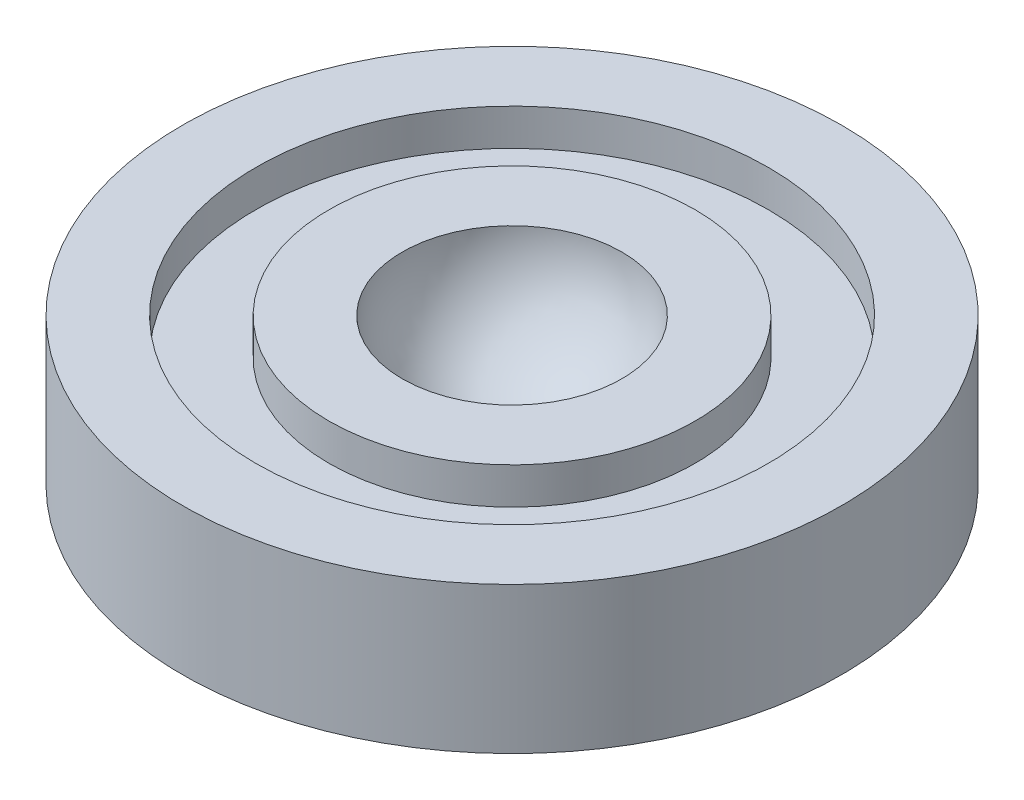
ISO-10303-21;
HEADER;
FILE_DESCRIPTION(('STEP AP214'),'2;1');
FILE_NAME('part.step','',(''),(''),'','','');
FILE_SCHEMA(('AUTOMOTIVE_DESIGN { 1 0 10303 214 1 1 1 1 }'));
ENDSEC;
DATA;
#1=APPLICATION_CONTEXT('core data for automotive mechanical design processes');
#2=APPLICATION_PROTOCOL_DEFINITION('international standard','automotive_design',2000,#1);
#3=PRODUCT_CONTEXT('',#1,'mechanical');
#4=PRODUCT('Part','Part','',(#3));
#5=PRODUCT_RELATED_PRODUCT_CATEGORY('part','',(#4));
#6=PRODUCT_DEFINITION_FORMATION('','',#4);
#7=PRODUCT_DEFINITION_CONTEXT('part definition',#1,'design');
#8=PRODUCT_DEFINITION('design','',#6,#7);
#9=PRODUCT_DEFINITION_SHAPE('','',#8);
#10=(LENGTH_UNIT() NAMED_UNIT(*) SI_UNIT(.MILLI.,.METRE.));
#11=(NAMED_UNIT(*) PLANE_ANGLE_UNIT() SI_UNIT($,.RADIAN.));
#12=(NAMED_UNIT(*) SI_UNIT($,.STERADIAN.) SOLID_ANGLE_UNIT());
#13=UNCERTAINTY_MEASURE_WITH_UNIT(LENGTH_MEASURE(1.E-05),#10,'distance_accuracy_value','');
#14=(GEOMETRIC_REPRESENTATION_CONTEXT(3) GLOBAL_UNCERTAINTY_ASSIGNED_CONTEXT((#13)) GLOBAL_UNIT_ASSIGNED_CONTEXT((#10,
#11,#12)) REPRESENTATION_CONTEXT('',''));
#15=CARTESIAN_POINT('',(0.,0.,0.));
#16=DIRECTION('',(0.,0.,1.));
#17=DIRECTION('',(1.,0.,0.));
#18=AXIS2_PLACEMENT_3D('',#15,#16,#17);
#19=CARTESIAN_POINT('',(0.,0.,0.));
#20=DIRECTION('',(0.,-1.,0.));
#21=DIRECTION('',(0.,0.,-1.));
#22=AXIS2_PLACEMENT_3D('',#19,#20,#21);
#23=SPHERICAL_SURFACE('',#22,15.);
#24=CARTESIAN_POINT('',(0.,0.,0.));
#25=DIRECTION('',(0.,-1.,0.));
#26=DIRECTION('',(0.,0.,-1.));
#27=AXIS2_PLACEMENT_3D('',#24,#25,#26);
#28=CIRCLE('',#27,15.);
#29=CARTESIAN_POINT('',(0.,0.,-15.));
#30=VERTEX_POINT('',#29);
#31=EDGE_CURVE('E10',#30,#30,#28,.T.);
#32=ORIENTED_EDGE('',*,*,#31,.F.);
#33=EDGE_LOOP('',(#32));
#34=FACE_BOUND('',#33,.T.);
#35=ADVANCED_FACE('F37',(#34),#23,.F.);
#36=CARTESIAN_POINT('',(0.,0.,15.));
#37=DIRECTION('',(0.,-1.,0.));
#38=DIRECTION('',(0.,0.,-1.));
#39=AXIS2_PLACEMENT_3D('',#36,#37,#38);
#40=PLANE('',#39);
#41=CARTESIAN_POINT('',(0.,0.,0.));
#42=DIRECTION('',(0.,-1.,0.));
#43=DIRECTION('',(0.,0.,-1.));
#44=AXIS2_PLACEMENT_3D('',#41,#42,#43);
#45=CIRCLE('',#44,25.);
#46=CARTESIAN_POINT('',(0.,0.,-25.));
#47=VERTEX_POINT('',#46);
#48=EDGE_CURVE('E43',#47,#47,#45,.T.);
#49=ORIENTED_EDGE('',*,*,#48,.F.);
#50=EDGE_LOOP('',(#49));
#51=FACE_BOUND('',#50,.T.);
#52=ORIENTED_EDGE('',*,*,#31,.T.);
#53=EDGE_LOOP('',(#52));
#54=FACE_BOUND('',#53,.T.);
#55=ADVANCED_FACE('F94',(#51,#54),#40,.F.);
#56=CARTESIAN_POINT('',(0.,0.,0.));
#57=DIRECTION('',(0.,-1.,0.));
#58=DIRECTION('',(0.,0.,-1.));
#59=AXIS2_PLACEMENT_3D('',#56,#57,#58);
#60=CYLINDRICAL_SURFACE('',#59,25.);
#61=CARTESIAN_POINT('',(0.,-5.,0.));
#62=DIRECTION('',(0.,-1.,0.));
#63=DIRECTION('',(0.,0.,-1.));
#64=AXIS2_PLACEMENT_3D('',#61,#62,#63);
#65=CIRCLE('',#64,25.);
#66=CARTESIAN_POINT('',(0.,-5.,-25.));
#67=VERTEX_POINT('',#66);
#68=EDGE_CURVE('E47',#67,#67,#65,.T.);
#69=ORIENTED_EDGE('',*,*,#68,.F.);
#70=EDGE_LOOP('',(#69));
#71=FACE_BOUND('',#70,.T.);
#72=ORIENTED_EDGE('',*,*,#48,.T.);
#73=EDGE_LOOP('',(#72));
#74=FACE_BOUND('',#73,.T.);
#75=ADVANCED_FACE('F89',(#71,#74),#60,.T.);
#76=CARTESIAN_POINT('',(0.,-5.,25.));
#77=DIRECTION('',(0.,-1.,0.));
#78=DIRECTION('',(0.,0.,-1.));
#79=AXIS2_PLACEMENT_3D('',#76,#77,#78);
#80=PLANE('',#79);
#81=CARTESIAN_POINT('',(0.,-5.,0.));
#82=DIRECTION('',(0.,-1.,0.));
#83=DIRECTION('',(0.,0.,-1.));
#84=AXIS2_PLACEMENT_3D('',#81,#82,#83);
#85=CIRCLE('',#84,35.);
#86=CARTESIAN_POINT('',(0.,-5.,-35.));
#87=VERTEX_POINT('',#86);
#88=EDGE_CURVE('E51',#87,#87,#85,.T.);
#89=ORIENTED_EDGE('',*,*,#88,.F.);
#90=EDGE_LOOP('',(#89));
#91=FACE_BOUND('',#90,.T.);
#92=ORIENTED_EDGE('',*,*,#68,.T.);
#93=EDGE_LOOP('',(#92));
#94=FACE_BOUND('',#93,.T.);
#95=ADVANCED_FACE('F83',(#91,#94),#80,.F.);
#96=CARTESIAN_POINT('',(0.,0.,0.));
#97=DIRECTION('',(0.,-1.,0.));
#98=DIRECTION('',(0.,0.,-1.));
#99=AXIS2_PLACEMENT_3D('',#96,#97,#98);
#100=CYLINDRICAL_SURFACE('',#99,35.);
#101=CARTESIAN_POINT('',(0.,0.,0.));
#102=DIRECTION('',(0.,-1.,0.));
#103=DIRECTION('',(0.,0.,-1.));
#104=AXIS2_PLACEMENT_3D('',#101,#102,#103);
#105=CIRCLE('',#104,35.);
#106=CARTESIAN_POINT('',(0.,0.,-35.));
#107=VERTEX_POINT('',#106);
#108=EDGE_CURVE('E56',#107,#107,#105,.T.);
#109=ORIENTED_EDGE('',*,*,#108,.F.);
#110=EDGE_LOOP('',(#109));
#111=FACE_BOUND('',#110,.T.);
#112=ORIENTED_EDGE('',*,*,#88,.T.);
#113=EDGE_LOOP('',(#112));
#114=FACE_BOUND('',#113,.T.);
#115=ADVANCED_FACE('F77',(#111,#114),#100,.F.);
#116=CARTESIAN_POINT('',(0.,0.,35.));
#117=DIRECTION('',(0.,-1.,0.));
#118=DIRECTION('',(0.,0.,-1.));
#119=AXIS2_PLACEMENT_3D('',#116,#117,#118);
#120=PLANE('',#119);
#121=CARTESIAN_POINT('',(0.,0.,0.));
#122=DIRECTION('',(0.,-1.,0.));
#123=DIRECTION('',(0.,0.,-1.));
#124=AXIS2_PLACEMENT_3D('',#121,#122,#123);
#125=CIRCLE('',#124,45.);
#126=CARTESIAN_POINT('',(0.,0.,-45.));
#127=VERTEX_POINT('',#126);
#128=EDGE_CURVE('E59',#127,#127,#125,.T.);
#129=ORIENTED_EDGE('',*,*,#128,.F.);
#130=EDGE_LOOP('',(#129));
#131=FACE_BOUND('',#130,.T.);
#132=ORIENTED_EDGE('',*,*,#108,.T.);
#133=EDGE_LOOP('',(#132));
#134=FACE_BOUND('',#133,.T.);
#135=ADVANCED_FACE('F71',(#131,#134),#120,.F.);
#136=CARTESIAN_POINT('',(0.,0.,0.));
#137=DIRECTION('',(0.,-1.,0.));
#138=DIRECTION('',(0.,0.,-1.));
#139=AXIS2_PLACEMENT_3D('',#136,#137,#138);
#140=CYLINDRICAL_SURFACE('',#139,45.);
#141=CARTESIAN_POINT('',(0.,-20.,0.));
#142=DIRECTION('',(0.,-1.,0.));
#143=DIRECTION('',(0.,0.,-1.));
#144=AXIS2_PLACEMENT_3D('',#141,#142,#143);
#145=CIRCLE('',#144,45.);
#146=CARTESIAN_POINT('',(0.,-20.,-45.));
#147=VERTEX_POINT('',#146);
#148=EDGE_CURVE('E62',#147,#147,#145,.T.);
#149=ORIENTED_EDGE('',*,*,#148,.F.);
#150=EDGE_LOOP('',(#149));
#151=FACE_BOUND('',#150,.T.);
#152=ORIENTED_EDGE('',*,*,#128,.T.);
#153=EDGE_LOOP('',(#152));
#154=FACE_BOUND('',#153,.T.);
#155=ADVANCED_FACE('F68',(#151,#154),#140,.T.);
#156=CARTESIAN_POINT('',(0.,-20.,45.));
#157=DIRECTION('',(0.,1.,0.));
#158=DIRECTION('',(0.,0.,1.));
#159=AXIS2_PLACEMENT_3D('',#156,#157,#158);
#160=PLANE('',#159);
#161=ORIENTED_EDGE('',*,*,#148,.T.);
#162=EDGE_LOOP('',(#161));
#163=FACE_BOUND('',#162,.T.);
#164=ADVANCED_FACE('F66',(#163),#160,.F.);
#165=CLOSED_SHELL('',(#35,#55,#75,#95,#115,#135,#155,#164));
#166=MANIFOLD_SOLID_BREP('B2',#165);
#167=ADVANCED_BREP_SHAPE_REPRESENTATION('',(#18,#166),#14);
#168=SHAPE_DEFINITION_REPRESENTATION(#9,#167);
ENDSEC;
END-ISO-10303-21;
